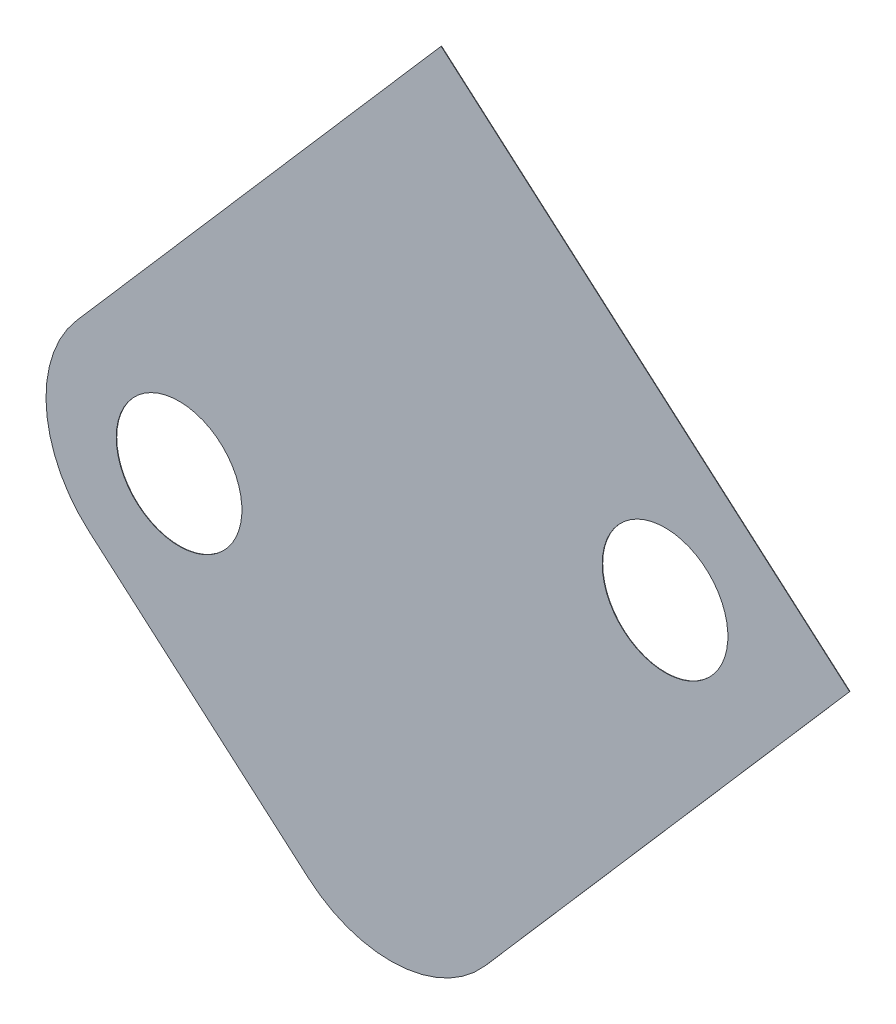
from build123d import *

# Parameters (mm, degrees)
BOSS_EXTRUDE1_DEPTH = 0.0254
HOLE1_D             = 7.1374


with BuildPart() as part:
    # Sketch1 → Boss-Extrude1 (new body)
    with BuildSketch(Plane.XY):
        with BuildLine():
            Line((-662.205965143, -84.907728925), (-685.411060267, -64.75574847))
            Line((-685.411060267, -64.75574847), (-706.115181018, -88.596635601))
            ThreePointArc((-706.115181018, -88.596635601), (-707.839839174, -93.7594789), (-705.408675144, -98.629677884))
            Line((-705.408675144, -98.629677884), (-692.943128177, -109.45512193))
            ThreePointArc((-692.943128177, -109.45512193), (-687.780284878, -111.179780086), (-682.910085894, -108.748616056))
            Line((-682.910085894, -108.748616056), (-662.205965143, -84.907728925))
        make_face()
    extrude(amount=BOSS_EXTRUDE1_DEPTH)

    # Hole1 (through all)
    with Locations(Plane(origin=(-669.032650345, -75.044634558, 0), x_dir=(-1, 0, 0), z_dir=(0, 0, -1))):
        with Locations((3.654260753, -10.601140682), (31.26485292, -18.183728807)):
            Hole(HOLE1_D / 2)


solid = part.part
